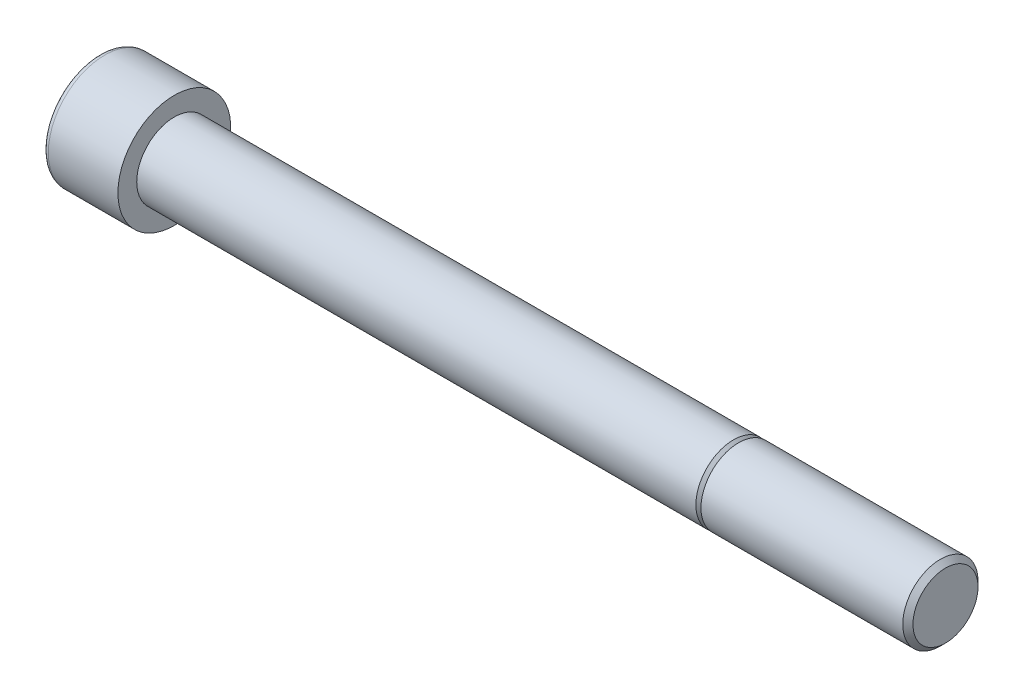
ISO-10303-21;
HEADER;
FILE_DESCRIPTION(('STEP AP214'),'2;1');
FILE_NAME('part.step','',(''),(''),'','','');
FILE_SCHEMA(('AUTOMOTIVE_DESIGN { 1 0 10303 214 1 1 1 1 }'));
ENDSEC;
DATA;
#1=APPLICATION_CONTEXT('core data for automotive mechanical design processes');
#2=APPLICATION_PROTOCOL_DEFINITION('international standard','automotive_design',2000,#1);
#3=PRODUCT_CONTEXT('',#1,'mechanical');
#4=PRODUCT('Part','Part','',(#3));
#5=PRODUCT_RELATED_PRODUCT_CATEGORY('part','',(#4));
#6=PRODUCT_DEFINITION_FORMATION('','',#4);
#7=PRODUCT_DEFINITION_CONTEXT('part definition',#1,'design');
#8=PRODUCT_DEFINITION('design','',#6,#7);
#9=PRODUCT_DEFINITION_SHAPE('','',#8);
#10=(LENGTH_UNIT() NAMED_UNIT(*) SI_UNIT(.MILLI.,.METRE.));
#11=(NAMED_UNIT(*) PLANE_ANGLE_UNIT() SI_UNIT($,.RADIAN.));
#12=(NAMED_UNIT(*) SI_UNIT($,.STERADIAN.) SOLID_ANGLE_UNIT());
#13=UNCERTAINTY_MEASURE_WITH_UNIT(LENGTH_MEASURE(1.E-05),#10,'distance_accuracy_value','');
#14=(GEOMETRIC_REPRESENTATION_CONTEXT(3) GLOBAL_UNCERTAINTY_ASSIGNED_CONTEXT((#13)) GLOBAL_UNIT_ASSIGNED_CONTEXT((#10,
#11,#12)) REPRESENTATION_CONTEXT('',''));
#15=CARTESIAN_POINT('',(0.,0.,0.));
#16=DIRECTION('',(0.,0.,1.));
#17=DIRECTION('',(1.,0.,0.));
#18=AXIS2_PLACEMENT_3D('',#15,#16,#17);
#19=CARTESIAN_POINT('',(80.,0.,0.));
#20=DIRECTION('',(-1.,0.,0.));
#21=DIRECTION('',(0.,0.,1.));
#22=AXIS2_PLACEMENT_3D('',#19,#20,#21);
#23=CYLINDRICAL_SURFACE('',#22,8.);
#24=CARTESIAN_POINT('',(78.9175,0.,0.));
#25=DIRECTION('',(1.,0.,0.));
#26=DIRECTION('',(0.,0.,-1.));
#27=AXIS2_PLACEMENT_3D('',#24,#25,#26);
#28=CIRCLE('',#27,8.);
#29=CARTESIAN_POINT('',(78.9175,0.,-8.));
#30=VERTEX_POINT('',#29);
#31=EDGE_CURVE('E154',#30,#30,#28,.F.);
#32=ORIENTED_EDGE('',*,*,#31,.T.);
#33=EDGE_LOOP('',(#32));
#34=FACE_BOUND('',#33,.T.);
#35=CARTESIAN_POINT('',(36.,0.,0.));
#36=DIRECTION('',(-1.,0.,0.));
#37=DIRECTION('',(0.,0.,1.));
#38=AXIS2_PLACEMENT_3D('',#35,#36,#37);
#39=CIRCLE('',#38,8.);
#40=CARTESIAN_POINT('',(36.,0.,8.));
#41=VERTEX_POINT('',#40);
#42=EDGE_CURVE('E134',#41,#41,#39,.T.);
#43=ORIENTED_EDGE('',*,*,#42,.F.);
#44=EDGE_LOOP('',(#43));
#45=FACE_BOUND('',#44,.T.);
#46=ADVANCED_FACE('F32',(#34,#45),#23,.T.);
#47=CARTESIAN_POINT('',(80.,8.,0.));
#48=DIRECTION('',(1.,0.,0.));
#49=DIRECTION('',(0.,0.,-1.));
#50=AXIS2_PLACEMENT_3D('',#47,#48,#49);
#51=PLANE('',#50);
#52=CARTESIAN_POINT('',(80.,0.,0.));
#53=DIRECTION('',(1.,0.,0.));
#54=DIRECTION('',(0.,0.,-1.));
#55=AXIS2_PLACEMENT_3D('',#52,#53,#54);
#56=CIRCLE('',#55,6.91749999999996);
#57=CARTESIAN_POINT('',(80.,0.,-6.91749999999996));
#58=VERTEX_POINT('',#57);
#59=EDGE_CURVE('E157',#58,#58,#56,.T.);
#60=ORIENTED_EDGE('',*,*,#59,.T.);
#61=EDGE_LOOP('',(#60));
#62=FACE_BOUND('',#61,.T.);
#63=ADVANCED_FACE('F174',(#62),#51,.T.);
#64=CARTESIAN_POINT('',(-100.,0.,0.));
#65=DIRECTION('',(-1.,0.,0.));
#66=DIRECTION('',(0.,0.,1.));
#67=AXIS2_PLACEMENT_3D('',#64,#65,#66);
#68=PLANE('',#67);
#69=CARTESIAN_POINT('',(-100.,0.,0.));
#70=DIRECTION('',(-1.,0.,0.));
#71=DIRECTION('',(0.,0.,1.));
#72=AXIS2_PLACEMENT_3D('',#69,#70,#71);
#73=CIRCLE('',#72,10.8);
#74=CARTESIAN_POINT('',(-100.,0.,10.8));
#75=VERTEX_POINT('',#74);
#76=EDGE_CURVE('E40',#75,#75,#73,.T.);
#77=ORIENTED_EDGE('',*,*,#76,.T.);
#78=EDGE_LOOP('',(#77));
#79=FACE_BOUND('',#78,.T.);
#80=DIRECTION('',(0.,-1.,0.));
#81=VECTOR('',#80,1.);
#82=CARTESIAN_POINT('',(-100.,4.04145188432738,-7.));
#83=LINE('',#82,#81);
#84=CARTESIAN_POINT('',(-100.,4.04145188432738,-7.));
#85=VERTEX_POINT('',#84);
#86=CARTESIAN_POINT('',(-100.,-4.04145188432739,-7.));
#87=VERTEX_POINT('',#86);
#88=EDGE_CURVE('E47',#85,#87,#83,.T.);
#89=ORIENTED_EDGE('',*,*,#88,.F.);
#90=DIRECTION('',(0.,-0.5,-0.866025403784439));
#91=VECTOR('',#90,1.);
#92=CARTESIAN_POINT('',(-100.,8.08290376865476,0.));
#93=LINE('',#92,#91);
#94=CARTESIAN_POINT('',(-100.,8.08290376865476,0.));
#95=VERTEX_POINT('',#94);
#96=EDGE_CURVE('E130',#95,#85,#93,.T.);
#97=ORIENTED_EDGE('',*,*,#96,.F.);
#98=DIRECTION('',(0.,0.499999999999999,-0.866025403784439));
#99=VECTOR('',#98,1.);
#100=CARTESIAN_POINT('',(-100.,4.04145188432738,7.));
#101=LINE('',#100,#99);
#102=CARTESIAN_POINT('',(-100.,4.04145188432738,7.));
#103=VERTEX_POINT('',#102);
#104=EDGE_CURVE('E128',#103,#95,#101,.T.);
#105=ORIENTED_EDGE('',*,*,#104,.F.);
#106=DIRECTION('',(0.,1.,0.));
#107=VECTOR('',#106,1.);
#108=CARTESIAN_POINT('',(-100.,-4.04145188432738,7.));
#109=LINE('',#108,#107);
#110=CARTESIAN_POINT('',(-100.,-4.04145188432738,7.));
#111=VERTEX_POINT('',#110);
#112=EDGE_CURVE('E95',#111,#103,#109,.T.);
#113=ORIENTED_EDGE('',*,*,#112,.F.);
#114=DIRECTION('',(0.,0.5,0.866025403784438));
#115=VECTOR('',#114,1.);
#116=CARTESIAN_POINT('',(-100.,-8.08290376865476,0.));
#117=LINE('',#116,#115);
#118=CARTESIAN_POINT('',(-100.,-8.08290376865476,0.));
#119=VERTEX_POINT('',#118);
#120=EDGE_CURVE('E124',#119,#111,#117,.T.);
#121=ORIENTED_EDGE('',*,*,#120,.F.);
#122=DIRECTION('',(0.,-0.499999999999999,0.866025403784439));
#123=VECTOR('',#122,1.);
#124=CARTESIAN_POINT('',(-100.,-4.04145188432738,-7.));
#125=LINE('',#124,#123);
#126=EDGE_CURVE('E121',#87,#119,#125,.T.);
#127=ORIENTED_EDGE('',*,*,#126,.F.);
#128=EDGE_LOOP('',(#89,#97,#105,#113,#121,#127));
#129=FACE_BOUND('',#128,.T.);
#130=ADVANCED_FACE('F162',(#79,#129),#68,.T.);
#131=CARTESIAN_POINT('',(80.,0.,0.));
#132=DIRECTION('',(-1.,0.,0.));
#133=DIRECTION('',(0.,0.,1.));
#134=AXIS2_PLACEMENT_3D('',#131,#132,#133);
#135=CYLINDRICAL_SURFACE('',#134,12.);
#136=CARTESIAN_POINT('',(-98.8,0.,0.));
#137=DIRECTION('',(-1.,0.,0.));
#138=DIRECTION('',(0.,0.,1.));
#139=AXIS2_PLACEMENT_3D('',#136,#137,#138);
#140=CIRCLE('',#139,12.);
#141=CARTESIAN_POINT('',(-98.8,0.,12.));
#142=VERTEX_POINT('',#141);
#143=EDGE_CURVE('E11',#142,#142,#140,.F.);
#144=ORIENTED_EDGE('',*,*,#143,.T.);
#145=EDGE_LOOP('',(#144));
#146=FACE_BOUND('',#145,.T.);
#147=CARTESIAN_POINT('',(-84.,0.,0.));
#148=DIRECTION('',(-1.,0.,0.));
#149=DIRECTION('',(0.,0.,1.));
#150=AXIS2_PLACEMENT_3D('',#147,#148,#149);
#151=CIRCLE('',#150,12.);
#152=CARTESIAN_POINT('',(-84.,0.,12.));
#153=VERTEX_POINT('',#152);
#154=EDGE_CURVE('E151',#153,#153,#151,.T.);
#155=ORIENTED_EDGE('',*,*,#154,.T.);
#156=EDGE_LOOP('',(#155));
#157=FACE_BOUND('',#156,.T.);
#158=ADVANCED_FACE('F186',(#146,#157),#135,.T.);
#159=CARTESIAN_POINT('',(-84.,12.,0.));
#160=DIRECTION('',(1.,0.,0.));
#161=DIRECTION('',(0.,0.,-1.));
#162=AXIS2_PLACEMENT_3D('',#159,#160,#161);
#163=PLANE('',#162);
#164=CARTESIAN_POINT('',(-84.,0.,0.));
#165=DIRECTION('',(-1.,0.,0.));
#166=DIRECTION('',(0.,0.,1.));
#167=AXIS2_PLACEMENT_3D('',#164,#165,#166);
#168=CIRCLE('',#167,8.00000000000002);
#169=CARTESIAN_POINT('',(-84.,0.,8.00000000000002));
#170=VERTEX_POINT('',#169);
#171=EDGE_CURVE('E148',#170,#170,#168,.T.);
#172=ORIENTED_EDGE('',*,*,#171,.T.);
#173=EDGE_LOOP('',(#172));
#174=FACE_BOUND('',#173,.T.);
#175=ORIENTED_EDGE('',*,*,#154,.F.);
#176=EDGE_LOOP('',(#175));
#177=FACE_BOUND('',#176,.T.);
#178=ADVANCED_FACE('F189',(#174,#177),#163,.T.);
#179=CARTESIAN_POINT('',(80.,0.,0.));
#180=DIRECTION('',(-1.,0.,0.));
#181=DIRECTION('',(0.,0.,1.));
#182=AXIS2_PLACEMENT_3D('',#179,#180,#181);
#183=CYLINDRICAL_SURFACE('',#182,8.00000000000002);
#184=CARTESIAN_POINT('',(34.9175,0.,0.));
#185=DIRECTION('',(-1.,0.,0.));
#186=DIRECTION('',(0.,0.,1.));
#187=AXIS2_PLACEMENT_3D('',#184,#185,#186);
#188=CIRCLE('',#187,8.00000000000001);
#189=CARTESIAN_POINT('',(34.9175,0.,8.00000000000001));
#190=VERTEX_POINT('',#189);
#191=EDGE_CURVE('E145',#190,#190,#188,.T.);
#192=ORIENTED_EDGE('',*,*,#191,.T.);
#193=EDGE_LOOP('',(#192));
#194=FACE_BOUND('',#193,.T.);
#195=ORIENTED_EDGE('',*,*,#171,.F.);
#196=EDGE_LOOP('',(#195));
#197=FACE_BOUND('',#196,.T.);
#198=ADVANCED_FACE('F193',(#194,#197),#183,.T.);
#199=CARTESIAN_POINT('',(34.9175,0.,0.));
#200=DIRECTION('',(-1.,0.,0.));
#201=DIRECTION('',(0.,0.,1.));
#202=AXIS2_PLACEMENT_3D('',#199,#200,#201);
#203=CONICAL_SURFACE('',#202,8.00000000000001,0.785398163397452);
#204=CARTESIAN_POINT('',(36.,0.,0.));
#205=DIRECTION('',(-1.,0.,0.));
#206=DIRECTION('',(0.,0.,1.));
#207=AXIS2_PLACEMENT_3D('',#204,#205,#206);
#208=CIRCLE('',#207,6.9175);
#209=CARTESIAN_POINT('',(36.,0.,6.9175));
#210=VERTEX_POINT('',#209);
#211=EDGE_CURVE('E142',#210,#210,#208,.T.);
#212=ORIENTED_EDGE('',*,*,#211,.T.);
#213=EDGE_LOOP('',(#212));
#214=FACE_BOUND('',#213,.T.);
#215=ORIENTED_EDGE('',*,*,#191,.F.);
#216=EDGE_LOOP('',(#215));
#217=FACE_BOUND('',#216,.T.);
#218=ADVANCED_FACE('F197',(#214,#217),#203,.T.);
#219=CARTESIAN_POINT('',(36.,6.9175,0.));
#220=DIRECTION('',(-1.,0.,0.));
#221=DIRECTION('',(0.,0.,1.));
#222=AXIS2_PLACEMENT_3D('',#219,#220,#221);
#223=PLANE('',#222);
#224=ORIENTED_EDGE('',*,*,#42,.T.);
#225=EDGE_LOOP('',(#224));
#226=FACE_BOUND('',#225,.T.);
#227=ORIENTED_EDGE('',*,*,#211,.F.);
#228=EDGE_LOOP('',(#227));
#229=FACE_BOUND('',#228,.T.);
#230=ADVANCED_FACE('F201',(#226,#229),#223,.T.);
#231=CARTESIAN_POINT('',(-92.,4.04145188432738,-7.));
#232=DIRECTION('',(0.,0.,-1.));
#233=DIRECTION('',(-1.,0.,0.));
#234=AXIS2_PLACEMENT_3D('',#231,#232,#233);
#235=PLANE('',#234);
#236=ORIENTED_EDGE('',*,*,#88,.T.);
#237=DIRECTION('',(-1.,0.,0.));
#238=VECTOR('',#237,1.);
#239=CARTESIAN_POINT('',(-92.,-4.04145188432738,-7.));
#240=LINE('',#239,#238);
#241=CARTESIAN_POINT('',(-92.,-4.04145188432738,-7.));
#242=VERTEX_POINT('',#241);
#243=EDGE_CURVE('E77',#242,#87,#240,.T.);
#244=ORIENTED_EDGE('',*,*,#243,.F.);
#245=DIRECTION('',(0.,-1.,0.));
#246=VECTOR('',#245,1.);
#247=CARTESIAN_POINT('',(-92.,4.04145188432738,-7.));
#248=LINE('',#247,#246);
#249=CARTESIAN_POINT('',(-92.,4.04145188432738,-7.));
#250=VERTEX_POINT('',#249);
#251=EDGE_CURVE('E132',#250,#242,#248,.T.);
#252=ORIENTED_EDGE('',*,*,#251,.F.);
#253=DIRECTION('',(-1.,0.,0.));
#254=VECTOR('',#253,1.);
#255=CARTESIAN_POINT('',(-92.,4.04145188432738,-7.));
#256=LINE('',#255,#254);
#257=EDGE_CURVE('E55',#250,#85,#256,.T.);
#258=ORIENTED_EDGE('',*,*,#257,.T.);
#259=EDGE_LOOP('',(#236,#244,#252,#258));
#260=FACE_BOUND('',#259,.T.);
#261=ADVANCED_FACE('F205',(#260),#235,.F.);
#262=CARTESIAN_POINT('',(-92.,8.08290376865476,0.));
#263=DIRECTION('',(0.,0.866025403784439,-0.5));
#264=DIRECTION('',(0.,0.5,0.866025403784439));
#265=AXIS2_PLACEMENT_3D('',#262,#263,#264);
#266=PLANE('',#265);
#267=ORIENTED_EDGE('',*,*,#96,.T.);
#268=ORIENTED_EDGE('',*,*,#257,.F.);
#269=DIRECTION('',(0.,-0.5,-0.866025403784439));
#270=VECTOR('',#269,1.);
#271=CARTESIAN_POINT('',(-92.,8.08290376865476,0.));
#272=LINE('',#271,#270);
#273=CARTESIAN_POINT('',(-92.,8.08290376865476,0.));
#274=VERTEX_POINT('',#273);
#275=EDGE_CURVE('E107',#274,#250,#272,.T.);
#276=ORIENTED_EDGE('',*,*,#275,.F.);
#277=DIRECTION('',(-1.,0.,0.));
#278=VECTOR('',#277,1.);
#279=CARTESIAN_POINT('',(-92.,8.08290376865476,0.));
#280=LINE('',#279,#278);
#281=EDGE_CURVE('E99',#274,#95,#280,.T.);
#282=ORIENTED_EDGE('',*,*,#281,.T.);
#283=EDGE_LOOP('',(#267,#268,#276,#282));
#284=FACE_BOUND('',#283,.T.);
#285=ADVANCED_FACE('F209',(#284),#266,.F.);
#286=CARTESIAN_POINT('',(-92.,4.04145188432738,7.));
#287=DIRECTION('',(0.,0.866025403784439,0.5));
#288=DIRECTION('',(0.,-0.499999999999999,0.866025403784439));
#289=AXIS2_PLACEMENT_3D('',#286,#287,#288);
#290=PLANE('',#289);
#291=ORIENTED_EDGE('',*,*,#104,.T.);
#292=ORIENTED_EDGE('',*,*,#281,.F.);
#293=DIRECTION('',(0.,0.499999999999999,-0.866025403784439));
#294=VECTOR('',#293,1.);
#295=CARTESIAN_POINT('',(-92.,4.04145188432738,7.));
#296=LINE('',#295,#294);
#297=CARTESIAN_POINT('',(-92.,4.04145188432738,7.));
#298=VERTEX_POINT('',#297);
#299=EDGE_CURVE('E103',#298,#274,#296,.T.);
#300=ORIENTED_EDGE('',*,*,#299,.F.);
#301=DIRECTION('',(-1.,0.,0.));
#302=VECTOR('',#301,1.);
#303=CARTESIAN_POINT('',(-92.,4.04145188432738,7.));
#304=LINE('',#303,#302);
#305=EDGE_CURVE('E88',#298,#103,#304,.T.);
#306=ORIENTED_EDGE('',*,*,#305,.T.);
#307=EDGE_LOOP('',(#291,#292,#300,#306));
#308=FACE_BOUND('',#307,.T.);
#309=ADVANCED_FACE('F104',(#308),#290,.F.);
#310=CARTESIAN_POINT('',(-92.,-4.04145188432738,7.));
#311=DIRECTION('',(0.,0.,1.));
#312=DIRECTION('',(1.,0.,0.));
#313=AXIS2_PLACEMENT_3D('',#310,#311,#312);
#314=PLANE('',#313);
#315=ORIENTED_EDGE('',*,*,#112,.T.);
#316=ORIENTED_EDGE('',*,*,#305,.F.);
#317=DIRECTION('',(0.,1.,0.));
#318=VECTOR('',#317,1.);
#319=CARTESIAN_POINT('',(-92.,-4.04145188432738,7.));
#320=LINE('',#319,#318);
#321=CARTESIAN_POINT('',(-92.,-4.04145188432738,7.));
#322=VERTEX_POINT('',#321);
#323=EDGE_CURVE('E92',#322,#298,#320,.T.);
#324=ORIENTED_EDGE('',*,*,#323,.F.);
#325=DIRECTION('',(-1.,0.,0.));
#326=VECTOR('',#325,1.);
#327=CARTESIAN_POINT('',(-92.,-4.04145188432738,7.));
#328=LINE('',#327,#326);
#329=EDGE_CURVE('E100',#322,#111,#328,.T.);
#330=ORIENTED_EDGE('',*,*,#329,.T.);
#331=EDGE_LOOP('',(#315,#316,#324,#330));
#332=FACE_BOUND('',#331,.T.);
#333=ADVANCED_FACE('F90',(#332),#314,.F.);
#334=CARTESIAN_POINT('',(-92.,-8.08290376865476,0.));
#335=DIRECTION('',(0.,-0.866025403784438,0.5));
#336=DIRECTION('',(0.,-0.5,-0.866025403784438));
#337=AXIS2_PLACEMENT_3D('',#334,#335,#336);
#338=PLANE('',#337);
#339=ORIENTED_EDGE('',*,*,#120,.T.);
#340=ORIENTED_EDGE('',*,*,#329,.F.);
#341=DIRECTION('',(0.,0.5,0.866025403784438));
#342=VECTOR('',#341,1.);
#343=CARTESIAN_POINT('',(-92.,-8.08290376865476,0.));
#344=LINE('',#343,#342);
#345=CARTESIAN_POINT('',(-92.,-8.08290376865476,0.));
#346=VERTEX_POINT('',#345);
#347=EDGE_CURVE('E113',#346,#322,#344,.T.);
#348=ORIENTED_EDGE('',*,*,#347,.F.);
#349=DIRECTION('',(-1.,0.,0.));
#350=VECTOR('',#349,1.);
#351=CARTESIAN_POINT('',(-92.,-8.08290376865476,0.));
#352=LINE('',#351,#350);
#353=EDGE_CURVE('E137',#346,#119,#352,.T.);
#354=ORIENTED_EDGE('',*,*,#353,.T.);
#355=EDGE_LOOP('',(#339,#340,#348,#354));
#356=FACE_BOUND('',#355,.T.);
#357=ADVANCED_FACE('F213',(#356),#338,.F.);
#358=CARTESIAN_POINT('',(-92.,-4.04145188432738,-7.));
#359=DIRECTION('',(0.,-0.866025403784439,-0.5));
#360=DIRECTION('',(0.,0.499999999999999,-0.866025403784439));
#361=AXIS2_PLACEMENT_3D('',#358,#359,#360);
#362=PLANE('',#361);
#363=ORIENTED_EDGE('',*,*,#126,.T.);
#364=ORIENTED_EDGE('',*,*,#353,.F.);
#365=DIRECTION('',(0.,-0.499999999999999,0.866025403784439));
#366=VECTOR('',#365,1.);
#367=CARTESIAN_POINT('',(-92.,-4.04145188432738,-7.));
#368=LINE('',#367,#366);
#369=EDGE_CURVE('E115',#242,#346,#368,.T.);
#370=ORIENTED_EDGE('',*,*,#369,.F.);
#371=ORIENTED_EDGE('',*,*,#243,.T.);
#372=EDGE_LOOP('',(#363,#364,#370,#371));
#373=FACE_BOUND('',#372,.T.);
#374=ADVANCED_FACE('F210',(#373),#362,.F.);
#375=CARTESIAN_POINT('',(-92.,-4.04145188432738,-7.));
#376=DIRECTION('',(-1.,0.,0.));
#377=DIRECTION('',(0.,0.,1.));
#378=AXIS2_PLACEMENT_3D('',#375,#376,#377);
#379=PLANE('',#378);
#380=ORIENTED_EDGE('',*,*,#251,.T.);
#381=ORIENTED_EDGE('',*,*,#369,.T.);
#382=ORIENTED_EDGE('',*,*,#347,.T.);
#383=ORIENTED_EDGE('',*,*,#323,.T.);
#384=ORIENTED_EDGE('',*,*,#299,.T.);
#385=ORIENTED_EDGE('',*,*,#275,.T.);
#386=EDGE_LOOP('',(#380,#381,#382,#383,#384,#385));
#387=FACE_BOUND('',#386,.T.);
#388=ADVANCED_FACE('F110',(#387),#379,.T.);
#389=CARTESIAN_POINT('',(78.9175,0.,0.));
#390=DIRECTION('',(-1.,0.,0.));
#391=DIRECTION('',(0.,0.,1.));
#392=AXIS2_PLACEMENT_3D('',#389,#390,#391);
#393=CONICAL_SURFACE('',#392,8.,0.785398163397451);
#394=ORIENTED_EDGE('',*,*,#59,.F.);
#395=EDGE_LOOP('',(#394));
#396=FACE_BOUND('',#395,.T.);
#397=ORIENTED_EDGE('',*,*,#31,.F.);
#398=EDGE_LOOP('',(#397));
#399=FACE_BOUND('',#398,.T.);
#400=ADVANCED_FACE('F166',(#396,#399),#393,.T.);
#401=CARTESIAN_POINT('',(-98.8,0.,0.));
#402=DIRECTION('',(-1.,0.,0.));
#403=DIRECTION('',(0.,0.,1.));
#404=AXIS2_PLACEMENT_3D('',#401,#402,#403);
#405=TOROIDAL_SURFACE('',#404,10.8,1.2);
#406=ORIENTED_EDGE('',*,*,#143,.F.);
#407=EDGE_LOOP('',(#406));
#408=FACE_BOUND('',#407,.T.);
#409=ORIENTED_EDGE('',*,*,#76,.F.);
#410=EDGE_LOOP('',(#409));
#411=FACE_BOUND('',#410,.T.);
#412=ADVANCED_FACE('F34',(#408,#411),#405,.T.);
#413=CLOSED_SHELL('',(#46,#63,#130,#158,#178,#198,#218,#230,#261,#285,#309,#333,#357,#374,#388,
#400,#412));
#414=MANIFOLD_SOLID_BREP('B2',#413);
#415=ADVANCED_BREP_SHAPE_REPRESENTATION('',(#18,#414),#14);
#416=SHAPE_DEFINITION_REPRESENTATION(#9,#415);
ENDSEC;
END-ISO-10303-21;
